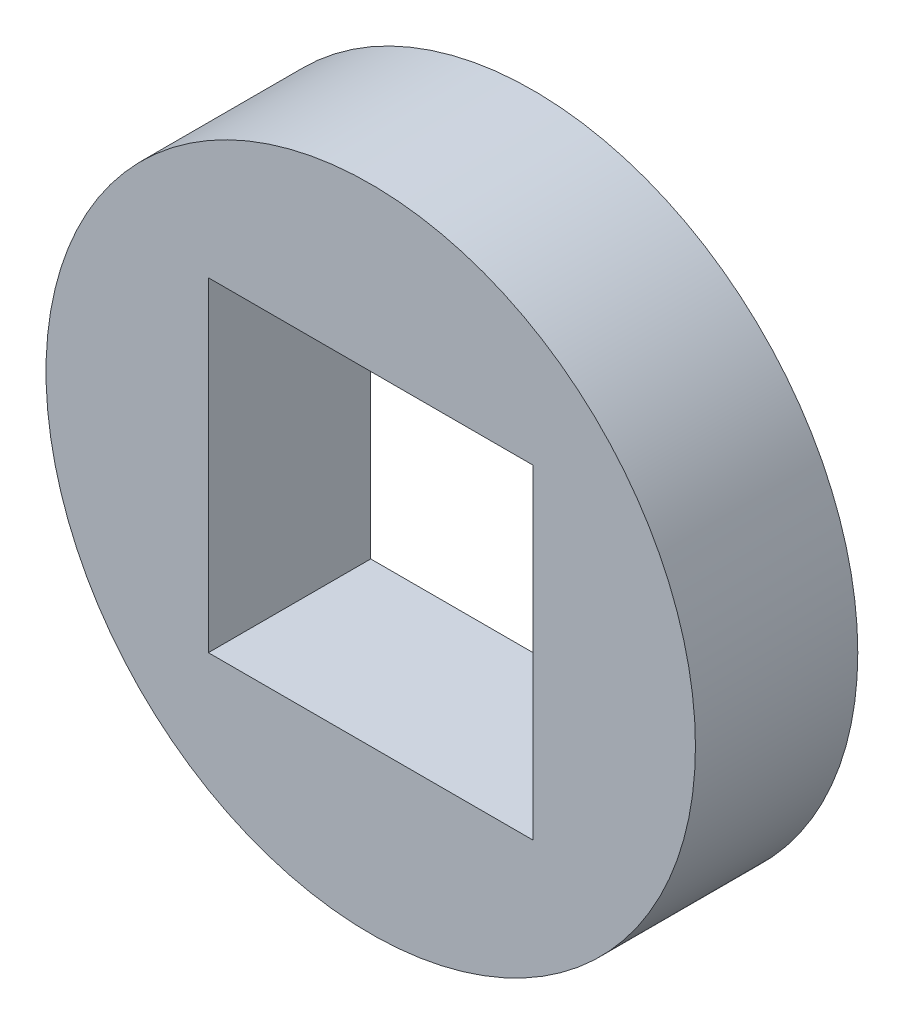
ISO-10303-21;
HEADER;
FILE_DESCRIPTION(('STEP AP214'),'2;1');
FILE_NAME('part.step','',(''),(''),'','','');
FILE_SCHEMA(('AUTOMOTIVE_DESIGN { 1 0 10303 214 1 1 1 1 }'));
ENDSEC;
DATA;
#1=APPLICATION_CONTEXT('core data for automotive mechanical design processes');
#2=APPLICATION_PROTOCOL_DEFINITION('international standard','automotive_design',2000,#1);
#3=PRODUCT_CONTEXT('',#1,'mechanical');
#4=PRODUCT('Part','Part','',(#3));
#5=PRODUCT_RELATED_PRODUCT_CATEGORY('part','',(#4));
#6=PRODUCT_DEFINITION_FORMATION('','',#4);
#7=PRODUCT_DEFINITION_CONTEXT('part definition',#1,'design');
#8=PRODUCT_DEFINITION('design','',#6,#7);
#9=PRODUCT_DEFINITION_SHAPE('','',#8);
#10=(LENGTH_UNIT() NAMED_UNIT(*) SI_UNIT(.MILLI.,.METRE.));
#11=(NAMED_UNIT(*) PLANE_ANGLE_UNIT() SI_UNIT($,.RADIAN.));
#12=(NAMED_UNIT(*) SI_UNIT($,.STERADIAN.) SOLID_ANGLE_UNIT());
#13=UNCERTAINTY_MEASURE_WITH_UNIT(LENGTH_MEASURE(1.E-05),#10,'distance_accuracy_value','');
#14=(GEOMETRIC_REPRESENTATION_CONTEXT(3) GLOBAL_UNCERTAINTY_ASSIGNED_CONTEXT((#13)) GLOBAL_UNIT_ASSIGNED_CONTEXT((#10,
#11,#12)) REPRESENTATION_CONTEXT('',''));
#15=CARTESIAN_POINT('',(0.,0.,0.));
#16=DIRECTION('',(0.,0.,1.));
#17=DIRECTION('',(1.,0.,0.));
#18=AXIS2_PLACEMENT_3D('',#15,#16,#17);
#19=CARTESIAN_POINT('',(0.,0.,3.175));
#20=DIRECTION('',(0.,0.,1.));
#21=DIRECTION('',(1.,0.,0.));
#22=AXIS2_PLACEMENT_3D('',#19,#20,#21);
#23=PLANE('',#22);
#24=CARTESIAN_POINT('',(0.,0.,3.175));
#25=DIRECTION('',(0.,0.,1.));
#26=DIRECTION('',(1.,0.,0.));
#27=AXIS2_PLACEMENT_3D('',#24,#25,#26);
#28=CIRCLE('',#27,6.35);
#29=CARTESIAN_POINT('',(6.35,0.,3.175));
#30=VERTEX_POINT('',#29);
#31=EDGE_CURVE('E11',#30,#30,#28,.T.);
#32=ORIENTED_EDGE('',*,*,#31,.T.);
#33=EDGE_LOOP('',(#32));
#34=FACE_BOUND('',#33,.T.);
#35=DIRECTION('',(-1.,0.,0.));
#36=VECTOR('',#35,1.);
#37=CARTESIAN_POINT('',(-3.175,3.175,3.175));
#38=LINE('',#37,#36);
#39=CARTESIAN_POINT('',(3.175,3.175,3.175));
#40=VERTEX_POINT('',#39);
#41=CARTESIAN_POINT('',(-3.175,3.175,3.175));
#42=VERTEX_POINT('',#41);
#43=EDGE_CURVE('E82',#40,#42,#38,.T.);
#44=ORIENTED_EDGE('',*,*,#43,.F.);
#45=DIRECTION('',(0.,1.,0.));
#46=VECTOR('',#45,1.);
#47=CARTESIAN_POINT('',(3.175,3.175,3.175));
#48=LINE('',#47,#46);
#49=CARTESIAN_POINT('',(3.175,-3.175,3.175));
#50=VERTEX_POINT('',#49);
#51=EDGE_CURVE('E74',#50,#40,#48,.T.);
#52=ORIENTED_EDGE('',*,*,#51,.F.);
#53=DIRECTION('',(1.,0.,0.));
#54=VECTOR('',#53,1.);
#55=CARTESIAN_POINT('',(-3.175,-3.175,3.175));
#56=LINE('',#55,#54);
#57=CARTESIAN_POINT('',(-3.175,-3.175,3.175));
#58=VERTEX_POINT('',#57);
#59=EDGE_CURVE('E95',#58,#50,#56,.T.);
#60=ORIENTED_EDGE('',*,*,#59,.F.);
#61=DIRECTION('',(0.,-1.,0.));
#62=VECTOR('',#61,1.);
#63=CARTESIAN_POINT('',(-3.175,3.175,3.175));
#64=LINE('',#63,#62);
#65=EDGE_CURVE('E93',#42,#58,#64,.T.);
#66=ORIENTED_EDGE('',*,*,#65,.F.);
#67=EDGE_LOOP('',(#44,#52,#60,#66));
#68=FACE_BOUND('',#67,.T.);
#69=ADVANCED_FACE('F33',(#34,#68),#23,.T.);
#70=CARTESIAN_POINT('',(0.,0.,0.));
#71=DIRECTION('',(0.,0.,1.));
#72=DIRECTION('',(1.,0.,0.));
#73=AXIS2_PLACEMENT_3D('',#70,#71,#72);
#74=PLANE('',#73);
#75=CARTESIAN_POINT('',(0.,0.,0.));
#76=DIRECTION('',(0.,0.,1.));
#77=DIRECTION('',(1.,0.,0.));
#78=AXIS2_PLACEMENT_3D('',#75,#76,#77);
#79=CIRCLE('',#78,6.35);
#80=CARTESIAN_POINT('',(6.35,0.,0.));
#81=VERTEX_POINT('',#80);
#82=EDGE_CURVE('E37',#81,#81,#79,.T.);
#83=ORIENTED_EDGE('',*,*,#82,.F.);
#84=EDGE_LOOP('',(#83));
#85=FACE_BOUND('',#84,.T.);
#86=DIRECTION('',(0.,1.,0.));
#87=VECTOR('',#86,1.);
#88=CARTESIAN_POINT('',(3.175,3.175,0.));
#89=LINE('',#88,#87);
#90=CARTESIAN_POINT('',(3.175,-3.175,0.));
#91=VERTEX_POINT('',#90);
#92=CARTESIAN_POINT('',(3.175,3.175,0.));
#93=VERTEX_POINT('',#92);
#94=EDGE_CURVE('E56',#91,#93,#89,.T.);
#95=ORIENTED_EDGE('',*,*,#94,.T.);
#96=DIRECTION('',(-1.,0.,0.));
#97=VECTOR('',#96,1.);
#98=CARTESIAN_POINT('',(-3.175,3.175,0.));
#99=LINE('',#98,#97);
#100=CARTESIAN_POINT('',(-3.175,3.175,0.));
#101=VERTEX_POINT('',#100);
#102=EDGE_CURVE('E89',#93,#101,#99,.T.);
#103=ORIENTED_EDGE('',*,*,#102,.T.);
#104=DIRECTION('',(0.,-1.,0.));
#105=VECTOR('',#104,1.);
#106=CARTESIAN_POINT('',(-3.175,3.175,0.));
#107=LINE('',#106,#105);
#108=CARTESIAN_POINT('',(-3.175,-3.175,0.));
#109=VERTEX_POINT('',#108);
#110=EDGE_CURVE('E101',#101,#109,#107,.T.);
#111=ORIENTED_EDGE('',*,*,#110,.T.);
#112=DIRECTION('',(1.,0.,0.));
#113=VECTOR('',#112,1.);
#114=CARTESIAN_POINT('',(-3.175,-3.175,0.));
#115=LINE('',#114,#113);
#116=EDGE_CURVE('E83',#109,#91,#115,.T.);
#117=ORIENTED_EDGE('',*,*,#116,.T.);
#118=EDGE_LOOP('',(#95,#103,#111,#117));
#119=FACE_BOUND('',#118,.T.);
#120=ADVANCED_FACE('F112',(#85,#119),#74,.F.);
#121=CARTESIAN_POINT('',(0.,0.,3.175));
#122=DIRECTION('',(0.,0.,-1.));
#123=DIRECTION('',(-1.,0.,0.));
#124=AXIS2_PLACEMENT_3D('',#121,#122,#123);
#125=CYLINDRICAL_SURFACE('',#124,6.35);
#126=ORIENTED_EDGE('',*,*,#31,.F.);
#127=EDGE_LOOP('',(#126));
#128=FACE_BOUND('',#127,.T.);
#129=ORIENTED_EDGE('',*,*,#82,.T.);
#130=EDGE_LOOP('',(#129));
#131=FACE_BOUND('',#130,.T.);
#132=ADVANCED_FACE('F35',(#128,#131),#125,.T.);
#133=CARTESIAN_POINT('',(3.175,3.175,3.175));
#134=DIRECTION('',(-1.,0.,0.));
#135=DIRECTION('',(0.,-1.,0.));
#136=AXIS2_PLACEMENT_3D('',#133,#134,#135);
#137=PLANE('',#136);
#138=ORIENTED_EDGE('',*,*,#94,.F.);
#139=DIRECTION('',(0.,0.,-1.));
#140=VECTOR('',#139,1.);
#141=CARTESIAN_POINT('',(3.175,-3.175,3.175));
#142=LINE('',#141,#140);
#143=EDGE_CURVE('E78',#50,#91,#142,.T.);
#144=ORIENTED_EDGE('',*,*,#143,.F.);
#145=ORIENTED_EDGE('',*,*,#51,.T.);
#146=DIRECTION('',(0.,0.,-1.));
#147=VECTOR('',#146,1.);
#148=CARTESIAN_POINT('',(3.175,3.175,3.175));
#149=LINE('',#148,#147);
#150=EDGE_CURVE('E77',#40,#93,#149,.T.);
#151=ORIENTED_EDGE('',*,*,#150,.T.);
#152=EDGE_LOOP('',(#138,#144,#145,#151));
#153=FACE_BOUND('',#152,.T.);
#154=ADVANCED_FACE('F76',(#153),#137,.T.);
#155=CARTESIAN_POINT('',(-3.175,3.175,3.175));
#156=DIRECTION('',(0.,-1.,0.));
#157=DIRECTION('',(0.,0.,-1.));
#158=AXIS2_PLACEMENT_3D('',#155,#156,#157);
#159=PLANE('',#158);
#160=ORIENTED_EDGE('',*,*,#102,.F.);
#161=ORIENTED_EDGE('',*,*,#150,.F.);
#162=ORIENTED_EDGE('',*,*,#43,.T.);
#163=DIRECTION('',(0.,0.,-1.));
#164=VECTOR('',#163,1.);
#165=CARTESIAN_POINT('',(-3.175,3.175,3.175));
#166=LINE('',#165,#164);
#167=EDGE_CURVE('E90',#42,#101,#166,.T.);
#168=ORIENTED_EDGE('',*,*,#167,.T.);
#169=EDGE_LOOP('',(#160,#161,#162,#168));
#170=FACE_BOUND('',#169,.T.);
#171=ADVANCED_FACE('F86',(#170),#159,.T.);
#172=CARTESIAN_POINT('',(-3.175,3.175,3.175));
#173=DIRECTION('',(1.,0.,0.));
#174=DIRECTION('',(0.,1.,0.));
#175=AXIS2_PLACEMENT_3D('',#172,#173,#174);
#176=PLANE('',#175);
#177=ORIENTED_EDGE('',*,*,#110,.F.);
#178=ORIENTED_EDGE('',*,*,#167,.F.);
#179=ORIENTED_EDGE('',*,*,#65,.T.);
#180=DIRECTION('',(0.,0.,-1.));
#181=VECTOR('',#180,1.);
#182=CARTESIAN_POINT('',(-3.175,-3.175,3.175));
#183=LINE('',#182,#181);
#184=EDGE_CURVE('E48',#58,#109,#183,.T.);
#185=ORIENTED_EDGE('',*,*,#184,.T.);
#186=EDGE_LOOP('',(#177,#178,#179,#185));
#187=FACE_BOUND('',#186,.T.);
#188=ADVANCED_FACE('F110',(#187),#176,.T.);
#189=CARTESIAN_POINT('',(-3.175,-3.175,3.175));
#190=DIRECTION('',(0.,1.,0.));
#191=DIRECTION('',(0.,0.,1.));
#192=AXIS2_PLACEMENT_3D('',#189,#190,#191);
#193=PLANE('',#192);
#194=ORIENTED_EDGE('',*,*,#116,.F.);
#195=ORIENTED_EDGE('',*,*,#184,.F.);
#196=ORIENTED_EDGE('',*,*,#59,.T.);
#197=ORIENTED_EDGE('',*,*,#143,.T.);
#198=EDGE_LOOP('',(#194,#195,#196,#197));
#199=FACE_BOUND('',#198,.T.);
#200=ADVANCED_FACE('F113',(#199),#193,.T.);
#201=CLOSED_SHELL('',(#69,#120,#132,#154,#171,#188,#200));
#202=MANIFOLD_SOLID_BREP('B2',#201);
#203=ADVANCED_BREP_SHAPE_REPRESENTATION('',(#18,#202),#14);
#204=SHAPE_DEFINITION_REPRESENTATION(#9,#203);
ENDSEC;
END-ISO-10303-21;
